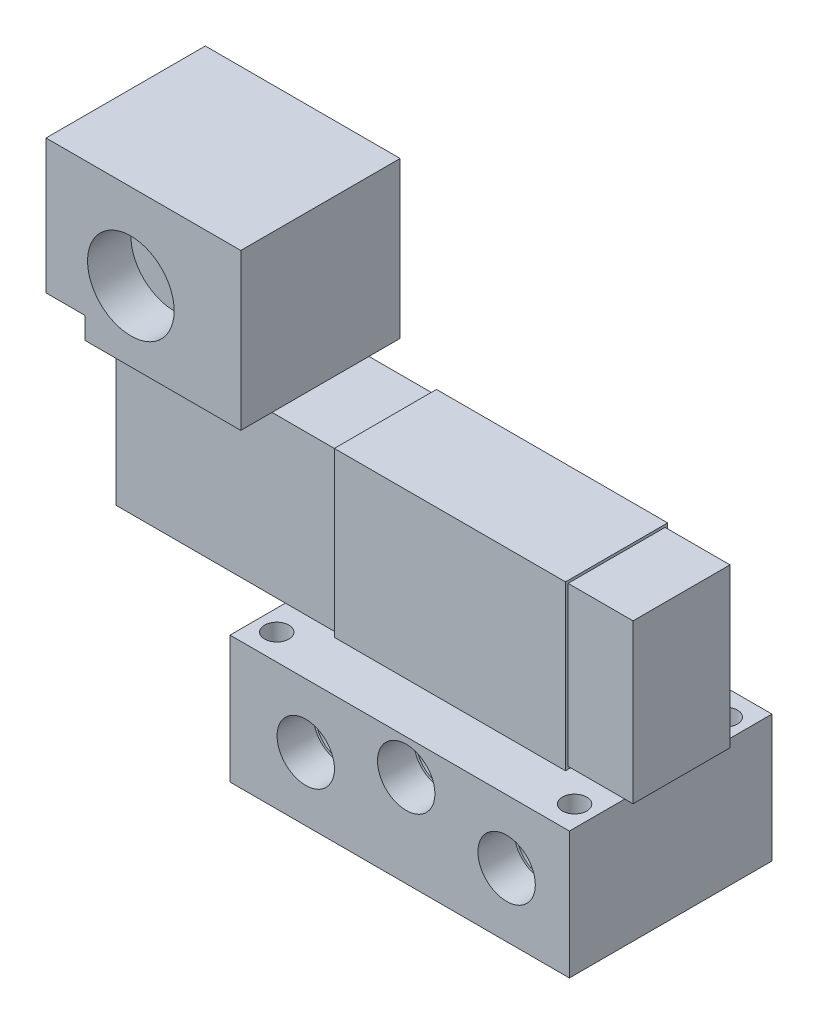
ISO-10303-21;
HEADER;
FILE_DESCRIPTION(('STEP AP214'),'2;1');
FILE_NAME('part.step','',(''),(''),'','','');
FILE_SCHEMA(('AUTOMOTIVE_DESIGN { 1 0 10303 214 1 1 1 1 }'));
ENDSEC;
DATA;
#1=APPLICATION_CONTEXT('core data for automotive mechanical design processes');
#2=APPLICATION_PROTOCOL_DEFINITION('international standard','automotive_design',2000,#1);
#3=PRODUCT_CONTEXT('',#1,'mechanical');
#4=PRODUCT('Part','Part','',(#3));
#5=PRODUCT_RELATED_PRODUCT_CATEGORY('part','',(#4));
#6=PRODUCT_DEFINITION_FORMATION('','',#4);
#7=PRODUCT_DEFINITION_CONTEXT('part definition',#1,'design');
#8=PRODUCT_DEFINITION('design','',#6,#7);
#9=PRODUCT_DEFINITION_SHAPE('','',#8);
#10=(LENGTH_UNIT() NAMED_UNIT(*) SI_UNIT(.MILLI.,.METRE.));
#11=(NAMED_UNIT(*) PLANE_ANGLE_UNIT() SI_UNIT($,.RADIAN.));
#12=(NAMED_UNIT(*) SI_UNIT($,.STERADIAN.) SOLID_ANGLE_UNIT());
#13=UNCERTAINTY_MEASURE_WITH_UNIT(LENGTH_MEASURE(1.E-05),#10,'distance_accuracy_value','');
#14=(GEOMETRIC_REPRESENTATION_CONTEXT(3) GLOBAL_UNCERTAINTY_ASSIGNED_CONTEXT((#13)) GLOBAL_UNIT_ASSIGNED_CONTEXT((#10,
#11,#12)) REPRESENTATION_CONTEXT('',''));
#15=CARTESIAN_POINT('',(0.,0.,0.));
#16=DIRECTION('',(0.,0.,1.));
#17=DIRECTION('',(1.,0.,0.));
#18=AXIS2_PLACEMENT_3D('',#15,#16,#17);
#19=CARTESIAN_POINT('',(83.693,85.344,-14.986));
#20=DIRECTION('',(1.,0.,0.));
#21=DIRECTION('',(0.,0.,-1.));
#22=AXIS2_PLACEMENT_3D('',#19,#20,#21);
#23=PLANE('',#22);
#24=DIRECTION('',(0.,0.,1.));
#25=VECTOR('',#24,1.);
#26=CARTESIAN_POINT('',(83.693,37.338,-14.986));
#27=LINE('',#26,#25);
#28=CARTESIAN_POINT('',(83.693,37.338,-14.986));
#29=VERTEX_POINT('',#28);
#30=CARTESIAN_POINT('',(83.693,37.338,14.986));
#31=VERTEX_POINT('',#30);
#32=EDGE_CURVE('E418',#29,#31,#27,.T.);
#33=ORIENTED_EDGE('',*,*,#32,.F.);
#34=DIRECTION('',(0.,-1.,0.));
#35=VECTOR('',#34,1.);
#36=CARTESIAN_POINT('',(83.693,85.344,-14.986));
#37=LINE('',#36,#35);
#38=CARTESIAN_POINT('',(83.693,85.344,-14.986));
#39=VERTEX_POINT('',#38);
#40=EDGE_CURVE('E428',#39,#29,#37,.T.);
#41=ORIENTED_EDGE('',*,*,#40,.F.);
#42=DIRECTION('',(0.,0.,1.));
#43=VECTOR('',#42,1.);
#44=CARTESIAN_POINT('',(83.693,85.344,-14.986));
#45=LINE('',#44,#43);
#46=CARTESIAN_POINT('',(83.693,85.344,14.986));
#47=VERTEX_POINT('',#46);
#48=EDGE_CURVE('E407',#39,#47,#45,.T.);
#49=ORIENTED_EDGE('',*,*,#48,.T.);
#50=DIRECTION('',(0.,-1.,0.));
#51=VECTOR('',#50,1.);
#52=CARTESIAN_POINT('',(83.693,85.344,14.986));
#53=LINE('',#52,#51);
#54=EDGE_CURVE('E426',#47,#31,#53,.T.);
#55=ORIENTED_EDGE('',*,*,#54,.T.);
#56=EDGE_LOOP('',(#33,#41,#49,#55));
#57=FACE_BOUND('',#56,.T.);
#58=DIRECTION('',(0.,0.,-1.));
#59=VECTOR('',#58,1.);
#60=CARTESIAN_POINT('',(83.693,38.1,14.224));
#61=LINE('',#60,#59);
#62=CARTESIAN_POINT('',(83.693,38.1,14.224));
#63=VERTEX_POINT('',#62);
#64=CARTESIAN_POINT('',(83.693,38.1,-14.224));
#65=VERTEX_POINT('',#64);
#66=EDGE_CURVE('E385',#63,#65,#61,.T.);
#67=ORIENTED_EDGE('',*,*,#66,.F.);
#68=DIRECTION('',(0.,-1.,0.));
#69=VECTOR('',#68,1.);
#70=CARTESIAN_POINT('',(83.693,84.582,14.224));
#71=LINE('',#70,#69);
#72=CARTESIAN_POINT('',(83.693,84.582,14.224));
#73=VERTEX_POINT('',#72);
#74=EDGE_CURVE('E371',#73,#63,#71,.T.);
#75=ORIENTED_EDGE('',*,*,#74,.F.);
#76=DIRECTION('',(0.,0.,1.));
#77=VECTOR('',#76,1.);
#78=CARTESIAN_POINT('',(83.693,84.582,-14.224));
#79=LINE('',#78,#77);
#80=CARTESIAN_POINT('',(83.693,84.582,-14.224));
#81=VERTEX_POINT('',#80);
#82=EDGE_CURVE('E376',#81,#73,#79,.T.);
#83=ORIENTED_EDGE('',*,*,#82,.F.);
#84=DIRECTION('',(0.,1.,0.));
#85=VECTOR('',#84,1.);
#86=CARTESIAN_POINT('',(83.693,38.1,-14.224));
#87=LINE('',#86,#85);
#88=EDGE_CURVE('E387',#65,#81,#87,.T.);
#89=ORIENTED_EDGE('',*,*,#88,.F.);
#90=EDGE_LOOP('',(#67,#75,#83,#89));
#91=FACE_BOUND('',#90,.T.);
#92=ADVANCED_FACE('F34',(#57,#91),#23,.T.);
#93=CARTESIAN_POINT('',(0.,37.338,29.718));
#94=DIRECTION('',(1.,0.,0.));
#95=DIRECTION('',(0.,1.,0.));
#96=AXIS2_PLACEMENT_3D('',#93,#94,#95);
#97=PLANE('',#96);
#98=DIRECTION('',(0.,-1.,0.));
#99=VECTOR('',#98,1.);
#100=CARTESIAN_POINT('',(0.,37.338,-29.718));
#101=LINE('',#100,#99);
#102=CARTESIAN_POINT('',(0.,37.338,-29.718));
#103=VERTEX_POINT('',#102);
#104=CARTESIAN_POINT('',(0.,0.,-29.718));
#105=VERTEX_POINT('',#104);
#106=EDGE_CURVE('E425',#103,#105,#101,.T.);
#107=ORIENTED_EDGE('',*,*,#106,.T.);
#108=DIRECTION('',(0.,0.,-1.));
#109=VECTOR('',#108,1.);
#110=CARTESIAN_POINT('',(0.,0.,29.718));
#111=LINE('',#110,#109);
#112=CARTESIAN_POINT('',(0.,0.,29.718));
#113=VERTEX_POINT('',#112);
#114=EDGE_CURVE('E11',#113,#105,#111,.T.);
#115=ORIENTED_EDGE('',*,*,#114,.F.);
#116=DIRECTION('',(0.,-1.,0.));
#117=VECTOR('',#116,1.);
#118=CARTESIAN_POINT('',(0.,37.338,29.718));
#119=LINE('',#118,#117);
#120=CARTESIAN_POINT('',(0.,37.338,29.718));
#121=VERTEX_POINT('',#120);
#122=EDGE_CURVE('E432',#121,#113,#119,.T.);
#123=ORIENTED_EDGE('',*,*,#122,.F.);
#124=DIRECTION('',(0.,0.,-1.));
#125=VECTOR('',#124,1.);
#126=CARTESIAN_POINT('',(0.,37.338,29.718));
#127=LINE('',#126,#125);
#128=EDGE_CURVE('E443',#121,#103,#127,.T.);
#129=ORIENTED_EDGE('',*,*,#128,.T.);
#130=EDGE_LOOP('',(#107,#115,#123,#129));
#131=FACE_BOUND('',#130,.T.);
#132=ADVANCED_FACE('F36',(#131),#97,.F.);
#133=CARTESIAN_POINT('',(99.568,0.,29.718));
#134=DIRECTION('',(0.,-1.,0.));
#135=DIRECTION('',(1.,0.,0.));
#136=AXIS2_PLACEMENT_3D('',#133,#134,#135);
#137=PLANE('',#136);
#138=CARTESIAN_POINT('',(6.096,0.,-22.098));
#139=DIRECTION('',(0.,1.,0.));
#140=DIRECTION('',(-1.,0.,0.));
#141=AXIS2_PLACEMENT_3D('',#138,#139,#140);
#142=CIRCLE('',#141,3.5687);
#143=CARTESIAN_POINT('',(2.5273,0.,-22.098));
#144=VERTEX_POINT('',#143);
#145=EDGE_CURVE('E743',#144,#144,#142,.T.);
#146=ORIENTED_EDGE('',*,*,#145,.T.);
#147=EDGE_LOOP('',(#146));
#148=FACE_BOUND('',#147,.T.);
#149=CARTESIAN_POINT('',(6.096,0.,22.098));
#150=DIRECTION('',(0.,1.,0.));
#151=DIRECTION('',(-1.,0.,0.));
#152=AXIS2_PLACEMENT_3D('',#149,#150,#151);
#153=CIRCLE('',#152,3.5687);
#154=CARTESIAN_POINT('',(2.5273,0.,22.098));
#155=VERTEX_POINT('',#154);
#156=EDGE_CURVE('E751',#155,#155,#153,.T.);
#157=ORIENTED_EDGE('',*,*,#156,.T.);
#158=EDGE_LOOP('',(#157));
#159=FACE_BOUND('',#158,.T.);
#160=CARTESIAN_POINT('',(93.472,0.,-22.098));
#161=DIRECTION('',(0.,1.,0.));
#162=DIRECTION('',(-1.,0.,0.));
#163=AXIS2_PLACEMENT_3D('',#160,#161,#162);
#164=CIRCLE('',#163,3.5687);
#165=CARTESIAN_POINT('',(89.9033,0.,-22.098));
#166=VERTEX_POINT('',#165);
#167=EDGE_CURVE('E757',#166,#166,#164,.T.);
#168=ORIENTED_EDGE('',*,*,#167,.T.);
#169=EDGE_LOOP('',(#168));
#170=FACE_BOUND('',#169,.T.);
#171=CARTESIAN_POINT('',(93.472,0.,22.098));
#172=DIRECTION('',(0.,1.,0.));
#173=DIRECTION('',(-1.,0.,0.));
#174=AXIS2_PLACEMENT_3D('',#171,#172,#173);
#175=CIRCLE('',#174,3.5687);
#176=CARTESIAN_POINT('',(89.9033,0.,22.098));
#177=VERTEX_POINT('',#176);
#178=EDGE_CURVE('E218',#177,#177,#175,.T.);
#179=ORIENTED_EDGE('',*,*,#178,.T.);
#180=EDGE_LOOP('',(#179));
#181=FACE_BOUND('',#180,.T.);
#182=DIRECTION('',(-1.,0.,0.));
#183=VECTOR('',#182,1.);
#184=CARTESIAN_POINT('',(99.568,0.,-29.718));
#185=LINE('',#184,#183);
#186=CARTESIAN_POINT('',(99.568,0.,-29.718));
#187=VERTEX_POINT('',#186);
#188=EDGE_CURVE('E446',#187,#105,#185,.T.);
#189=ORIENTED_EDGE('',*,*,#188,.F.);
#190=DIRECTION('',(0.,0.,-1.));
#191=VECTOR('',#190,1.);
#192=CARTESIAN_POINT('',(99.568,0.,29.718));
#193=LINE('',#192,#191);
#194=CARTESIAN_POINT('',(99.568,0.,29.718));
#195=VERTEX_POINT('',#194);
#196=EDGE_CURVE('E43',#195,#187,#193,.T.);
#197=ORIENTED_EDGE('',*,*,#196,.F.);
#198=DIRECTION('',(-1.,0.,0.));
#199=VECTOR('',#198,1.);
#200=CARTESIAN_POINT('',(99.568,0.,29.718));
#201=LINE('',#200,#199);
#202=EDGE_CURVE('E434',#195,#113,#201,.T.);
#203=ORIENTED_EDGE('',*,*,#202,.T.);
#204=ORIENTED_EDGE('',*,*,#114,.T.);
#205=EDGE_LOOP('',(#189,#197,#203,#204));
#206=FACE_BOUND('',#205,.T.);
#207=ADVANCED_FACE('F508',(#148,#159,#170,#181,#206),#137,.T.);
#208=CARTESIAN_POINT('',(99.568,0.,29.718));
#209=DIRECTION('',(-1.,0.,0.));
#210=DIRECTION('',(0.,-1.,0.));
#211=AXIS2_PLACEMENT_3D('',#208,#209,#210);
#212=PLANE('',#211);
#213=DIRECTION('',(0.,1.,0.));
#214=VECTOR('',#213,1.);
#215=CARTESIAN_POINT('',(99.568,0.,-29.718));
#216=LINE('',#215,#214);
#217=CARTESIAN_POINT('',(99.568,37.338,-29.718));
#218=VERTEX_POINT('',#217);
#219=EDGE_CURVE('E449',#187,#218,#216,.T.);
#220=ORIENTED_EDGE('',*,*,#219,.T.);
#221=DIRECTION('',(0.,0.,-1.));
#222=VECTOR('',#221,1.);
#223=CARTESIAN_POINT('',(99.568,37.338,29.718));
#224=LINE('',#223,#222);
#225=CARTESIAN_POINT('',(99.568,37.338,29.718));
#226=VERTEX_POINT('',#225);
#227=EDGE_CURVE('E455',#226,#218,#224,.T.);
#228=ORIENTED_EDGE('',*,*,#227,.F.);
#229=DIRECTION('',(0.,1.,0.));
#230=VECTOR('',#229,1.);
#231=CARTESIAN_POINT('',(99.568,0.,29.718));
#232=LINE('',#231,#230);
#233=EDGE_CURVE('E438',#195,#226,#232,.T.);
#234=ORIENTED_EDGE('',*,*,#233,.F.);
#235=ORIENTED_EDGE('',*,*,#196,.T.);
#236=EDGE_LOOP('',(#220,#228,#234,#235));
#237=FACE_BOUND('',#236,.T.);
#238=ADVANCED_FACE('F506',(#237),#212,.F.);
#239=CARTESIAN_POINT('',(0.,37.338,29.718));
#240=DIRECTION('',(0.,1.,0.));
#241=DIRECTION('',(-1.,0.,0.));
#242=AXIS2_PLACEMENT_3D('',#239,#240,#241);
#243=PLANE('',#242);
#244=CARTESIAN_POINT('',(6.09599999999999,37.338,-22.098));
#245=DIRECTION('',(0.,1.,0.));
#246=DIRECTION('',(-1.,0.,0.));
#247=AXIS2_PLACEMENT_3D('',#244,#245,#246);
#248=CIRCLE('',#247,3.5687);
#249=CARTESIAN_POINT('',(2.52729999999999,37.338,-22.098));
#250=VERTEX_POINT('',#249);
#251=EDGE_CURVE('E746',#250,#250,#248,.T.);
#252=ORIENTED_EDGE('',*,*,#251,.F.);
#253=EDGE_LOOP('',(#252));
#254=FACE_BOUND('',#253,.T.);
#255=CARTESIAN_POINT('',(6.09599999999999,37.338,22.098));
#256=DIRECTION('',(0.,1.,0.));
#257=DIRECTION('',(-1.,0.,0.));
#258=AXIS2_PLACEMENT_3D('',#255,#256,#257);
#259=CIRCLE('',#258,3.5687);
#260=CARTESIAN_POINT('',(2.52729999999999,37.338,22.098));
#261=VERTEX_POINT('',#260);
#262=EDGE_CURVE('E748',#261,#261,#259,.T.);
#263=ORIENTED_EDGE('',*,*,#262,.F.);
#264=EDGE_LOOP('',(#263));
#265=FACE_BOUND('',#264,.T.);
#266=CARTESIAN_POINT('',(93.472,37.338,-22.098));
#267=DIRECTION('',(0.,1.,0.));
#268=DIRECTION('',(-1.,0.,0.));
#269=AXIS2_PLACEMENT_3D('',#266,#267,#268);
#270=CIRCLE('',#269,3.5687);
#271=CARTESIAN_POINT('',(89.9033,37.338,-22.098));
#272=VERTEX_POINT('',#271);
#273=EDGE_CURVE('E754',#272,#272,#270,.T.);
#274=ORIENTED_EDGE('',*,*,#273,.F.);
#275=EDGE_LOOP('',(#274));
#276=FACE_BOUND('',#275,.T.);
#277=CARTESIAN_POINT('',(93.472,37.338,22.098));
#278=DIRECTION('',(0.,1.,0.));
#279=DIRECTION('',(-1.,0.,0.));
#280=AXIS2_PLACEMENT_3D('',#277,#278,#279);
#281=CIRCLE('',#280,3.5687);
#282=CARTESIAN_POINT('',(89.9033,37.338,22.098));
#283=VERTEX_POINT('',#282);
#284=EDGE_CURVE('E223',#283,#283,#281,.T.);
#285=ORIENTED_EDGE('',*,*,#284,.F.);
#286=EDGE_LOOP('',(#285));
#287=FACE_BOUND('',#286,.T.);
#288=DIRECTION('',(0.,0.,-1.));
#289=VECTOR('',#288,1.);
#290=CARTESIAN_POINT('',(15.875,37.338,14.986));
#291=LINE('',#290,#289);
#292=CARTESIAN_POINT('',(15.875,37.338,14.986));
#293=VERTEX_POINT('',#292);
#294=CARTESIAN_POINT('',(15.875,37.338,-14.986));
#295=VERTEX_POINT('',#294);
#296=EDGE_CURVE('E400',#293,#295,#291,.T.);
#297=ORIENTED_EDGE('',*,*,#296,.T.);
#298=DIRECTION('',(-1.,0.,0.));
#299=VECTOR('',#298,1.);
#300=CARTESIAN_POINT('',(83.693,37.338,-14.986));
#301=LINE('',#300,#299);
#302=EDGE_CURVE('E415',#29,#295,#301,.T.);
#303=ORIENTED_EDGE('',*,*,#302,.F.);
#304=ORIENTED_EDGE('',*,*,#32,.T.);
#305=DIRECTION('',(1.,0.,0.));
#306=VECTOR('',#305,1.);
#307=CARTESIAN_POINT('',(15.875,37.338,14.986));
#308=LINE('',#307,#306);
#309=EDGE_CURVE('E405',#293,#31,#308,.T.);
#310=ORIENTED_EDGE('',*,*,#309,.F.);
#311=EDGE_LOOP('',(#297,#303,#304,#310));
#312=FACE_BOUND('',#311,.T.);
#313=DIRECTION('',(1.,0.,0.));
#314=VECTOR('',#313,1.);
#315=CARTESIAN_POINT('',(0.,37.338,-29.718));
#316=LINE('',#315,#314);
#317=EDGE_CURVE('E435',#103,#218,#316,.T.);
#318=ORIENTED_EDGE('',*,*,#317,.F.);
#319=ORIENTED_EDGE('',*,*,#128,.F.);
#320=DIRECTION('',(1.,0.,0.));
#321=VECTOR('',#320,1.);
#322=CARTESIAN_POINT('',(0.,37.338,29.718));
#323=LINE('',#322,#321);
#324=EDGE_CURVE('E440',#121,#226,#323,.T.);
#325=ORIENTED_EDGE('',*,*,#324,.T.);
#326=ORIENTED_EDGE('',*,*,#227,.T.);
#327=EDGE_LOOP('',(#318,#319,#325,#326));
#328=FACE_BOUND('',#327,.T.);
#329=ADVANCED_FACE('F500',(#254,#265,#276,#287,#312,#328),#243,.T.);
#330=CARTESIAN_POINT('',(0.,0.,29.718));
#331=DIRECTION('',(0.,0.,-1.));
#332=DIRECTION('',(-1.,0.,0.));
#333=AXIS2_PLACEMENT_3D('',#330,#331,#332);
#334=PLANE('',#333);
#335=CARTESIAN_POINT('',(22.225,18.669,29.7180000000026));
#336=DIRECTION('',(0.,0.,1.));
#337=DIRECTION('',(1.,0.,0.));
#338=AXIS2_PLACEMENT_3D('',#335,#336,#337);
#339=CIRCLE('',#338,8.4201);
#340=CARTESIAN_POINT('',(30.6451,18.669,29.7180000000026));
#341=VERTEX_POINT('',#340);
#342=EDGE_CURVE('E256',#341,#341,#339,.T.);
#343=ORIENTED_EDGE('',*,*,#342,.F.);
#344=EDGE_LOOP('',(#343));
#345=FACE_BOUND('',#344,.T.);
#346=CARTESIAN_POINT('',(81.153,18.669,29.7180000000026));
#347=DIRECTION('',(0.,0.,1.));
#348=DIRECTION('',(1.,0.,0.));
#349=AXIS2_PLACEMENT_3D('',#346,#347,#348);
#350=CIRCLE('',#349,8.42009999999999);
#351=CARTESIAN_POINT('',(89.5731,18.669,29.7180000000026));
#352=VERTEX_POINT('',#351);
#353=EDGE_CURVE('E266',#352,#352,#350,.T.);
#354=ORIENTED_EDGE('',*,*,#353,.F.);
#355=EDGE_LOOP('',(#354));
#356=FACE_BOUND('',#355,.T.);
#357=CARTESIAN_POINT('',(51.689,27.051,29.7180000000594));
#358=DIRECTION('',(0.,0.,1.));
#359=DIRECTION('',(1.,0.,0.));
#360=AXIS2_PLACEMENT_3D('',#357,#358,#359);
#361=CIRCLE('',#360,8.4201);
#362=CARTESIAN_POINT('',(60.1091,27.051,29.7180000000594));
#363=VERTEX_POINT('',#362);
#364=EDGE_CURVE('E276',#363,#363,#361,.T.);
#365=ORIENTED_EDGE('',*,*,#364,.F.);
#366=EDGE_LOOP('',(#365));
#367=FACE_BOUND('',#366,.T.);
#368=ORIENTED_EDGE('',*,*,#122,.T.);
#369=ORIENTED_EDGE('',*,*,#202,.F.);
#370=ORIENTED_EDGE('',*,*,#233,.T.);
#371=ORIENTED_EDGE('',*,*,#324,.F.);
#372=EDGE_LOOP('',(#368,#369,#370,#371));
#373=FACE_BOUND('',#372,.T.);
#374=ADVANCED_FACE('F488',(#345,#356,#367,#373),#334,.F.);
#375=CARTESIAN_POINT('',(0.,0.,-29.718));
#376=DIRECTION('',(0.,0.,-1.));
#377=DIRECTION('',(-1.,0.,0.));
#378=AXIS2_PLACEMENT_3D('',#375,#376,#377);
#379=PLANE('',#378);
#380=CARTESIAN_POINT('',(22.225,18.669,-29.7179999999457));
#381=DIRECTION('',(0.,0.,-1.));
#382=DIRECTION('',(-1.,0.,0.));
#383=AXIS2_PLACEMENT_3D('',#380,#381,#382);
#384=CIRCLE('',#383,8.4201);
#385=CARTESIAN_POINT('',(13.8049,18.669,-29.7179999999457));
#386=VERTEX_POINT('',#385);
#387=EDGE_CURVE('E221',#386,#386,#384,.T.);
#388=ORIENTED_EDGE('',*,*,#387,.F.);
#389=EDGE_LOOP('',(#388));
#390=FACE_BOUND('',#389,.T.);
#391=CARTESIAN_POINT('',(51.689,27.051,-29.7180000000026));
#392=DIRECTION('',(0.,0.,-1.));
#393=DIRECTION('',(-1.,0.,0.));
#394=AXIS2_PLACEMENT_3D('',#391,#392,#393);
#395=CIRCLE('',#394,8.4201);
#396=CARTESIAN_POINT('',(43.2689,27.051,-29.7180000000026));
#397=VERTEX_POINT('',#396);
#398=EDGE_CURVE('E236',#397,#397,#395,.T.);
#399=ORIENTED_EDGE('',*,*,#398,.F.);
#400=EDGE_LOOP('',(#399));
#401=FACE_BOUND('',#400,.T.);
#402=CARTESIAN_POINT('',(81.153,18.669,-29.7180000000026));
#403=DIRECTION('',(0.,0.,-1.));
#404=DIRECTION('',(-1.,0.,0.));
#405=AXIS2_PLACEMENT_3D('',#402,#403,#404);
#406=CIRCLE('',#405,8.42009999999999);
#407=CARTESIAN_POINT('',(72.7329,18.669,-29.7180000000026));
#408=VERTEX_POINT('',#407);
#409=EDGE_CURVE('E246',#408,#408,#406,.T.);
#410=ORIENTED_EDGE('',*,*,#409,.F.);
#411=EDGE_LOOP('',(#410));
#412=FACE_BOUND('',#411,.T.);
#413=ORIENTED_EDGE('',*,*,#106,.F.);
#414=ORIENTED_EDGE('',*,*,#317,.T.);
#415=ORIENTED_EDGE('',*,*,#219,.F.);
#416=ORIENTED_EDGE('',*,*,#188,.T.);
#417=EDGE_LOOP('',(#413,#414,#415,#416));
#418=FACE_BOUND('',#417,.T.);
#419=ADVANCED_FACE('F484',(#390,#401,#412,#418),#379,.T.);
#420=CARTESIAN_POINT('',(15.875,85.344,14.986));
#421=DIRECTION('',(-1.,0.,0.));
#422=DIRECTION('',(0.,0.,1.));
#423=AXIS2_PLACEMENT_3D('',#420,#421,#422);
#424=PLANE('',#423);
#425=DIRECTION('',(0.,0.,1.));
#426=VECTOR('',#425,1.);
#427=CARTESIAN_POINT('',(15.875,84.582,-14.224));
#428=LINE('',#427,#426);
#429=CARTESIAN_POINT('',(15.875,84.582,-14.224));
#430=VERTEX_POINT('',#429);
#431=CARTESIAN_POINT('',(15.875,84.582,14.224));
#432=VERTEX_POINT('',#431);
#433=EDGE_CURVE('E333',#430,#432,#428,.T.);
#434=ORIENTED_EDGE('',*,*,#433,.T.);
#435=DIRECTION('',(0.,-1.,0.));
#436=VECTOR('',#435,1.);
#437=CARTESIAN_POINT('',(15.875,84.582,14.224));
#438=LINE('',#437,#436);
#439=CARTESIAN_POINT('',(15.875,38.1,14.224));
#440=VERTEX_POINT('',#439);
#441=EDGE_CURVE('E355',#432,#440,#438,.T.);
#442=ORIENTED_EDGE('',*,*,#441,.T.);
#443=DIRECTION('',(0.,0.,-1.));
#444=VECTOR('',#443,1.);
#445=CARTESIAN_POINT('',(15.875,38.1,14.224));
#446=LINE('',#445,#444);
#447=CARTESIAN_POINT('',(15.875,38.1,-14.224));
#448=VERTEX_POINT('',#447);
#449=EDGE_CURVE('E58',#440,#448,#446,.T.);
#450=ORIENTED_EDGE('',*,*,#449,.T.);
#451=DIRECTION('',(0.,1.,0.));
#452=VECTOR('',#451,1.);
#453=CARTESIAN_POINT('',(15.875,38.1,-14.224));
#454=LINE('',#453,#452);
#455=EDGE_CURVE('E358',#448,#430,#454,.T.);
#456=ORIENTED_EDGE('',*,*,#455,.T.);
#457=EDGE_LOOP('',(#434,#442,#450,#456));
#458=FACE_BOUND('',#457,.T.);
#459=ORIENTED_EDGE('',*,*,#296,.F.);
#460=DIRECTION('',(0.,-1.,0.));
#461=VECTOR('',#460,1.);
#462=CARTESIAN_POINT('',(15.875,85.344,14.986));
#463=LINE('',#462,#461);
#464=CARTESIAN_POINT('',(15.875,85.344,14.986));
#465=VERTEX_POINT('',#464);
#466=EDGE_CURVE('E423',#465,#293,#463,.T.);
#467=ORIENTED_EDGE('',*,*,#466,.F.);
#468=DIRECTION('',(0.,0.,-1.));
#469=VECTOR('',#468,1.);
#470=CARTESIAN_POINT('',(15.875,85.344,14.986));
#471=LINE('',#470,#469);
#472=CARTESIAN_POINT('',(15.875,85.344,-14.986));
#473=VERTEX_POINT('',#472);
#474=EDGE_CURVE('E401',#465,#473,#471,.T.);
#475=ORIENTED_EDGE('',*,*,#474,.T.);
#476=DIRECTION('',(0.,-1.,0.));
#477=VECTOR('',#476,1.);
#478=CARTESIAN_POINT('',(15.875,85.344,-14.986));
#479=LINE('',#478,#477);
#480=EDGE_CURVE('E412',#473,#295,#479,.T.);
#481=ORIENTED_EDGE('',*,*,#480,.T.);
#482=EDGE_LOOP('',(#459,#467,#475,#481));
#483=FACE_BOUND('',#482,.T.);
#484=ADVANCED_FACE('F487',(#458,#483),#424,.T.);
#485=CARTESIAN_POINT('',(15.875,85.344,14.986));
#486=DIRECTION('',(0.,0.,-1.));
#487=DIRECTION('',(-1.,0.,0.));
#488=AXIS2_PLACEMENT_3D('',#485,#486,#487);
#489=PLANE('',#488);
#490=ORIENTED_EDGE('',*,*,#309,.T.);
#491=ORIENTED_EDGE('',*,*,#54,.F.);
#492=DIRECTION('',(1.,0.,0.));
#493=VECTOR('',#492,1.);
#494=CARTESIAN_POINT('',(15.875,85.344,14.986));
#495=LINE('',#494,#493);
#496=EDGE_CURVE('E410',#465,#47,#495,.T.);
#497=ORIENTED_EDGE('',*,*,#496,.F.);
#498=ORIENTED_EDGE('',*,*,#466,.T.);
#499=EDGE_LOOP('',(#490,#491,#497,#498));
#500=FACE_BOUND('',#499,.T.);
#501=ADVANCED_FACE('F531',(#500),#489,.F.);
#502=CARTESIAN_POINT('',(83.693,85.344,-14.986));
#503=DIRECTION('',(0.,0.,1.));
#504=DIRECTION('',(1.,0.,0.));
#505=AXIS2_PLACEMENT_3D('',#502,#503,#504);
#506=PLANE('',#505);
#507=ORIENTED_EDGE('',*,*,#302,.T.);
#508=ORIENTED_EDGE('',*,*,#480,.F.);
#509=DIRECTION('',(-1.,0.,0.));
#510=VECTOR('',#509,1.);
#511=CARTESIAN_POINT('',(83.693,85.344,-14.986));
#512=LINE('',#511,#510);
#513=EDGE_CURVE('E404',#39,#473,#512,.T.);
#514=ORIENTED_EDGE('',*,*,#513,.F.);
#515=ORIENTED_EDGE('',*,*,#40,.T.);
#516=EDGE_LOOP('',(#507,#508,#514,#515));
#517=FACE_BOUND('',#516,.T.);
#518=ADVANCED_FACE('F533',(#517),#506,.F.);
#519=CARTESIAN_POINT('',(15.875,85.344,14.986));
#520=DIRECTION('',(0.,-1.,0.));
#521=DIRECTION('',(1.,0.,0.));
#522=AXIS2_PLACEMENT_3D('',#519,#520,#521);
#523=PLANE('',#522);
#524=ORIENTED_EDGE('',*,*,#474,.F.);
#525=ORIENTED_EDGE('',*,*,#496,.T.);
#526=ORIENTED_EDGE('',*,*,#48,.F.);
#527=ORIENTED_EDGE('',*,*,#513,.T.);
#528=EDGE_LOOP('',(#524,#525,#526,#527));
#529=FACE_BOUND('',#528,.T.);
#530=ADVANCED_FACE('F535',(#529),#523,.F.);
#531=CARTESIAN_POINT('',(102.743,84.582,14.224));
#532=DIRECTION('',(0.,0.,-1.));
#533=DIRECTION('',(-1.,0.,0.));
#534=AXIS2_PLACEMENT_3D('',#531,#532,#533);
#535=PLANE('',#534);
#536=ORIENTED_EDGE('',*,*,#74,.T.);
#537=DIRECTION('',(-1.,0.,0.));
#538=VECTOR('',#537,1.);
#539=CARTESIAN_POINT('',(102.743,38.1,14.224));
#540=LINE('',#539,#538);
#541=CARTESIAN_POINT('',(102.743,38.1,14.224));
#542=VERTEX_POINT('',#541);
#543=EDGE_CURVE('E398',#542,#63,#540,.T.);
#544=ORIENTED_EDGE('',*,*,#543,.F.);
#545=DIRECTION('',(0.,-1.,0.));
#546=VECTOR('',#545,1.);
#547=CARTESIAN_POINT('',(102.743,84.582,14.224));
#548=LINE('',#547,#546);
#549=CARTESIAN_POINT('',(102.743,84.582,14.224));
#550=VERTEX_POINT('',#549);
#551=EDGE_CURVE('E372',#550,#542,#548,.T.);
#552=ORIENTED_EDGE('',*,*,#551,.F.);
#553=DIRECTION('',(-1.,0.,0.));
#554=VECTOR('',#553,1.);
#555=CARTESIAN_POINT('',(102.743,84.582,14.224));
#556=LINE('',#555,#554);
#557=EDGE_CURVE('E382',#550,#73,#556,.T.);
#558=ORIENTED_EDGE('',*,*,#557,.T.);
#559=EDGE_LOOP('',(#536,#544,#552,#558));
#560=FACE_BOUND('',#559,.T.);
#561=ADVANCED_FACE('F557',(#560),#535,.F.);
#562=CARTESIAN_POINT('',(102.743,38.1,14.224));
#563=DIRECTION('',(0.,1.,0.));
#564=DIRECTION('',(-1.,0.,0.));
#565=AXIS2_PLACEMENT_3D('',#562,#563,#564);
#566=PLANE('',#565);
#567=ORIENTED_EDGE('',*,*,#66,.T.);
#568=DIRECTION('',(-1.,0.,0.));
#569=VECTOR('',#568,1.);
#570=CARTESIAN_POINT('',(102.743,38.1,-14.224));
#571=LINE('',#570,#569);
#572=CARTESIAN_POINT('',(102.743,38.1,-14.224));
#573=VERTEX_POINT('',#572);
#574=EDGE_CURVE('E395',#573,#65,#571,.T.);
#575=ORIENTED_EDGE('',*,*,#574,.F.);
#576=DIRECTION('',(0.,0.,-1.));
#577=VECTOR('',#576,1.);
#578=CARTESIAN_POINT('',(102.743,38.1,14.224));
#579=LINE('',#578,#577);
#580=EDGE_CURVE('E375',#542,#573,#579,.T.);
#581=ORIENTED_EDGE('',*,*,#580,.F.);
#582=ORIENTED_EDGE('',*,*,#543,.T.);
#583=EDGE_LOOP('',(#567,#575,#581,#582));
#584=FACE_BOUND('',#583,.T.);
#585=ADVANCED_FACE('F561',(#584),#566,.F.);
#586=CARTESIAN_POINT('',(102.743,38.1,-14.224));
#587=DIRECTION('',(0.,0.,1.));
#588=DIRECTION('',(1.,0.,0.));
#589=AXIS2_PLACEMENT_3D('',#586,#587,#588);
#590=PLANE('',#589);
#591=ORIENTED_EDGE('',*,*,#88,.T.);
#592=DIRECTION('',(-1.,0.,0.));
#593=VECTOR('',#592,1.);
#594=CARTESIAN_POINT('',(102.743,84.582,-14.224));
#595=LINE('',#594,#593);
#596=CARTESIAN_POINT('',(102.743,84.582,-14.224));
#597=VERTEX_POINT('',#596);
#598=EDGE_CURVE('E393',#597,#81,#595,.T.);
#599=ORIENTED_EDGE('',*,*,#598,.F.);
#600=DIRECTION('',(0.,1.,0.));
#601=VECTOR('',#600,1.);
#602=CARTESIAN_POINT('',(102.743,38.1,-14.224));
#603=LINE('',#602,#601);
#604=EDGE_CURVE('E378',#573,#597,#603,.T.);
#605=ORIENTED_EDGE('',*,*,#604,.F.);
#606=ORIENTED_EDGE('',*,*,#574,.T.);
#607=EDGE_LOOP('',(#591,#599,#605,#606));
#608=FACE_BOUND('',#607,.T.);
#609=ADVANCED_FACE('F567',(#608),#590,.F.);
#610=CARTESIAN_POINT('',(102.743,84.582,-14.224));
#611=DIRECTION('',(0.,-1.,0.));
#612=DIRECTION('',(1.,0.,0.));
#613=AXIS2_PLACEMENT_3D('',#610,#611,#612);
#614=PLANE('',#613);
#615=ORIENTED_EDGE('',*,*,#82,.T.);
#616=ORIENTED_EDGE('',*,*,#557,.F.);
#617=DIRECTION('',(0.,0.,1.));
#618=VECTOR('',#617,1.);
#619=CARTESIAN_POINT('',(102.743,84.582,-14.224));
#620=LINE('',#619,#618);
#621=EDGE_CURVE('E380',#597,#550,#620,.T.);
#622=ORIENTED_EDGE('',*,*,#621,.F.);
#623=ORIENTED_EDGE('',*,*,#598,.T.);
#624=EDGE_LOOP('',(#615,#616,#622,#623));
#625=FACE_BOUND('',#624,.T.);
#626=ADVANCED_FACE('F571',(#625),#614,.F.);
#627=CARTESIAN_POINT('',(102.743,38.1,14.224));
#628=DIRECTION('',(1.,0.,0.));
#629=DIRECTION('',(0.,0.,-1.));
#630=AXIS2_PLACEMENT_3D('',#627,#628,#629);
#631=PLANE('',#630);
#632=ORIENTED_EDGE('',*,*,#551,.T.);
#633=ORIENTED_EDGE('',*,*,#580,.T.);
#634=ORIENTED_EDGE('',*,*,#604,.T.);
#635=ORIENTED_EDGE('',*,*,#621,.T.);
#636=EDGE_LOOP('',(#632,#633,#634,#635));
#637=FACE_BOUND('',#636,.T.);
#638=ADVANCED_FACE('F575',(#637),#631,.T.);
#639=CARTESIAN_POINT('',(-103.391468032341,84.582,-14.224));
#640=DIRECTION('',(0.,1.,0.));
#641=DIRECTION('',(-1.,0.,0.));
#642=AXIS2_PLACEMENT_3D('',#639,#640,#641);
#643=PLANE('',#642);
#644=DIRECTION('',(0.,0.,-1.));
#645=VECTOR('',#644,1.);
#646=CARTESIAN_POINT('',(-3.17499999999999,84.582,23.368));
#647=LINE('',#646,#645);
#648=CARTESIAN_POINT('',(-3.17499999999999,84.582,14.224));
#649=VERTEX_POINT('',#648);
#650=CARTESIAN_POINT('',(-3.17499999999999,84.582,-14.224));
#651=VERTEX_POINT('',#650);
#652=EDGE_CURVE('E342',#649,#651,#647,.T.);
#653=ORIENTED_EDGE('',*,*,#652,.F.);
#654=DIRECTION('',(1.,0.,0.));
#655=VECTOR('',#654,1.);
#656=CARTESIAN_POINT('',(-103.391468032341,84.582,14.224));
#657=LINE('',#656,#655);
#658=EDGE_CURVE('E360',#649,#432,#657,.T.);
#659=ORIENTED_EDGE('',*,*,#658,.T.);
#660=ORIENTED_EDGE('',*,*,#433,.F.);
#661=DIRECTION('',(1.,0.,0.));
#662=VECTOR('',#661,1.);
#663=CARTESIAN_POINT('',(-103.391468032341,84.582,-14.224));
#664=LINE('',#663,#662);
#665=EDGE_CURVE('E51',#651,#430,#664,.T.);
#666=ORIENTED_EDGE('',*,*,#665,.F.);
#667=EDGE_LOOP('',(#653,#659,#660,#666));
#668=FACE_BOUND('',#667,.T.);
#669=ADVANCED_FACE('F579',(#668),#643,.T.);
#670=CARTESIAN_POINT('',(-103.391468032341,38.1,-14.224));
#671=DIRECTION('',(0.,0.,-1.));
#672=DIRECTION('',(-1.,0.,0.));
#673=AXIS2_PLACEMENT_3D('',#670,#671,#672);
#674=PLANE('',#673);
#675=DIRECTION('',(0.,-1.,0.));
#676=VECTOR('',#675,1.);
#677=CARTESIAN_POINT('',(-48.895,38.1,-14.224));
#678=LINE('',#677,#676);
#679=CARTESIAN_POINT('',(-48.895,84.582,-14.224));
#680=VERTEX_POINT('',#679);
#681=CARTESIAN_POINT('',(-48.895,38.1,-14.224));
#682=VERTEX_POINT('',#681);
#683=EDGE_CURVE('E349',#680,#682,#678,.T.);
#684=ORIENTED_EDGE('',*,*,#683,.F.);
#685=EDGE_CURVE('E350',#680,#651,#664,.T.);
#686=ORIENTED_EDGE('',*,*,#685,.T.);
#687=ORIENTED_EDGE('',*,*,#665,.T.);
#688=ORIENTED_EDGE('',*,*,#455,.F.);
#689=DIRECTION('',(1.,0.,0.));
#690=VECTOR('',#689,1.);
#691=CARTESIAN_POINT('',(-103.391468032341,38.1,-14.224));
#692=LINE('',#691,#690);
#693=EDGE_CURVE('E362',#682,#448,#692,.T.);
#694=ORIENTED_EDGE('',*,*,#693,.F.);
#695=EDGE_LOOP('',(#684,#686,#687,#688,#694));
#696=FACE_BOUND('',#695,.T.);
#697=ADVANCED_FACE('F583',(#696),#674,.T.);
#698=CARTESIAN_POINT('',(-103.391468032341,38.1,14.224));
#699=DIRECTION('',(0.,-1.,0.));
#700=DIRECTION('',(1.,0.,0.));
#701=AXIS2_PLACEMENT_3D('',#698,#699,#700);
#702=PLANE('',#701);
#703=DIRECTION('',(0.,0.,1.));
#704=VECTOR('',#703,1.);
#705=CARTESIAN_POINT('',(-48.895,38.1,14.224));
#706=LINE('',#705,#704);
#707=CARTESIAN_POINT('',(-48.895,38.1,14.224));
#708=VERTEX_POINT('',#707);
#709=EDGE_CURVE('E347',#682,#708,#706,.T.);
#710=ORIENTED_EDGE('',*,*,#709,.F.);
#711=ORIENTED_EDGE('',*,*,#693,.T.);
#712=ORIENTED_EDGE('',*,*,#449,.F.);
#713=DIRECTION('',(1.,0.,0.));
#714=VECTOR('',#713,1.);
#715=CARTESIAN_POINT('',(-103.391468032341,38.1,14.224));
#716=LINE('',#715,#714);
#717=EDGE_CURVE('E364',#708,#440,#716,.T.);
#718=ORIENTED_EDGE('',*,*,#717,.F.);
#719=EDGE_LOOP('',(#710,#711,#712,#718));
#720=FACE_BOUND('',#719,.T.);
#721=ADVANCED_FACE('F589',(#720),#702,.T.);
#722=CARTESIAN_POINT('',(-103.391468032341,84.582,14.224));
#723=DIRECTION('',(0.,0.,1.));
#724=DIRECTION('',(1.,0.,0.));
#725=AXIS2_PLACEMENT_3D('',#722,#723,#724);
#726=PLANE('',#725);
#727=DIRECTION('',(0.,1.,0.));
#728=VECTOR('',#727,1.);
#729=CARTESIAN_POINT('',(-48.895,84.582,14.224));
#730=LINE('',#729,#728);
#731=CARTESIAN_POINT('',(-48.895,84.582,14.224));
#732=VERTEX_POINT('',#731);
#733=EDGE_CURVE('E352',#708,#732,#730,.T.);
#734=ORIENTED_EDGE('',*,*,#733,.F.);
#735=ORIENTED_EDGE('',*,*,#717,.T.);
#736=ORIENTED_EDGE('',*,*,#441,.F.);
#737=ORIENTED_EDGE('',*,*,#658,.F.);
#738=EDGE_CURVE('E367',#732,#649,#657,.T.);
#739=ORIENTED_EDGE('',*,*,#738,.F.);
#740=EDGE_LOOP('',(#734,#735,#736,#737,#739));
#741=FACE_BOUND('',#740,.T.);
#742=ADVANCED_FACE('F585',(#741),#726,.T.);
#743=CARTESIAN_POINT('',(-48.895,0.,0.));
#744=DIRECTION('',(1.,0.,0.));
#745=DIRECTION('',(0.,0.,-1.));
#746=AXIS2_PLACEMENT_3D('',#743,#744,#745);
#747=PLANE('',#746);
#748=ORIENTED_EDGE('',*,*,#733,.T.);
#749=DIRECTION('',(0.,0.,-1.));
#750=VECTOR('',#749,1.);
#751=CARTESIAN_POINT('',(-48.895,84.582,23.368));
#752=LINE('',#751,#750);
#753=CARTESIAN_POINT('',(-48.895,84.582,23.368));
#754=VERTEX_POINT('',#753);
#755=EDGE_CURVE('E336',#754,#732,#752,.T.);
#756=ORIENTED_EDGE('',*,*,#755,.F.);
#757=DIRECTION('',(0.,1.,0.));
#758=VECTOR('',#757,1.);
#759=CARTESIAN_POINT('',(-48.895,84.582,23.368));
#760=LINE('',#759,#758);
#761=CARTESIAN_POINT('',(-48.895,90.932,23.368));
#762=VERTEX_POINT('',#761);
#763=EDGE_CURVE('E308',#754,#762,#760,.T.);
#764=ORIENTED_EDGE('',*,*,#763,.T.);
#765=DIRECTION('',(0.,0.,-1.));
#766=VECTOR('',#765,1.);
#767=CARTESIAN_POINT('',(-48.895,90.932,23.368));
#768=LINE('',#767,#766);
#769=CARTESIAN_POINT('',(-48.895,90.932,-23.368));
#770=VERTEX_POINT('',#769);
#771=EDGE_CURVE('E334',#762,#770,#768,.T.);
#772=ORIENTED_EDGE('',*,*,#771,.T.);
#773=DIRECTION('',(0.,1.,0.));
#774=VECTOR('',#773,1.);
#775=CARTESIAN_POINT('',(-48.895,84.582,-23.368));
#776=LINE('',#775,#774);
#777=CARTESIAN_POINT('',(-48.895,84.582,-23.368));
#778=VERTEX_POINT('',#777);
#779=EDGE_CURVE('E326',#778,#770,#776,.T.);
#780=ORIENTED_EDGE('',*,*,#779,.F.);
#781=EDGE_CURVE('E338',#680,#778,#752,.T.);
#782=ORIENTED_EDGE('',*,*,#781,.F.);
#783=ORIENTED_EDGE('',*,*,#683,.T.);
#784=ORIENTED_EDGE('',*,*,#709,.T.);
#785=EDGE_LOOP('',(#748,#756,#764,#772,#780,#782,#783,#784));
#786=FACE_BOUND('',#785,.T.);
#787=ADVANCED_FACE('F588',(#786),#747,.F.);
#788=CARTESIAN_POINT('',(-3.17499999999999,84.582,23.368));
#789=DIRECTION('',(0.,-1.,0.));
#790=DIRECTION('',(1.,0.,0.));
#791=AXIS2_PLACEMENT_3D('',#788,#789,#790);
#792=PLANE('',#791);
#793=CARTESIAN_POINT('',(-3.17499999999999,84.582,-23.368));
#794=VERTEX_POINT('',#793);
#795=EDGE_CURVE('E343',#651,#794,#647,.T.);
#796=ORIENTED_EDGE('',*,*,#795,.F.);
#797=ORIENTED_EDGE('',*,*,#685,.F.);
#798=ORIENTED_EDGE('',*,*,#781,.T.);
#799=DIRECTION('',(-1.,0.,0.));
#800=VECTOR('',#799,1.);
#801=CARTESIAN_POINT('',(-3.17499999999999,84.582,-23.368));
#802=LINE('',#801,#800);
#803=EDGE_CURVE('E323',#794,#778,#802,.T.);
#804=ORIENTED_EDGE('',*,*,#803,.F.);
#805=EDGE_LOOP('',(#796,#797,#798,#804));
#806=FACE_BOUND('',#805,.T.);
#807=ADVANCED_FACE('F598',(#806),#792,.T.);
#808=CARTESIAN_POINT('',(-60.325,90.932,23.368));
#809=DIRECTION('',(-1.,0.,0.));
#810=DIRECTION('',(0.,0.,1.));
#811=AXIS2_PLACEMENT_3D('',#808,#809,#810);
#812=PLANE('',#811);
#813=DIRECTION('',(0.,1.,0.));
#814=VECTOR('',#813,1.);
#815=CARTESIAN_POINT('',(-60.325,90.932,-23.368));
#816=LINE('',#815,#814);
#817=CARTESIAN_POINT('',(-60.325,90.932,-23.368));
#818=VERTEX_POINT('',#817);
#819=CARTESIAN_POINT('',(-60.325,130.302,-23.368));
#820=VERTEX_POINT('',#819);
#821=EDGE_CURVE('E292',#818,#820,#816,.T.);
#822=ORIENTED_EDGE('',*,*,#821,.F.);
#823=DIRECTION('',(0.,0.,-1.));
#824=VECTOR('',#823,1.);
#825=CARTESIAN_POINT('',(-60.325,90.932,23.368));
#826=LINE('',#825,#824);
#827=CARTESIAN_POINT('',(-60.325,90.932,23.368));
#828=VERTEX_POINT('',#827);
#829=EDGE_CURVE('E331',#828,#818,#826,.T.);
#830=ORIENTED_EDGE('',*,*,#829,.F.);
#831=DIRECTION('',(0.,1.,0.));
#832=VECTOR('',#831,1.);
#833=CARTESIAN_POINT('',(-60.325,90.932,23.368));
#834=LINE('',#833,#832);
#835=CARTESIAN_POINT('',(-60.325,130.302,23.368));
#836=VERTEX_POINT('',#835);
#837=EDGE_CURVE('E295',#828,#836,#834,.T.);
#838=ORIENTED_EDGE('',*,*,#837,.T.);
#839=DIRECTION('',(0.,0.,-1.));
#840=VECTOR('',#839,1.);
#841=CARTESIAN_POINT('',(-60.325,130.302,23.368));
#842=LINE('',#841,#840);
#843=EDGE_CURVE('E314',#836,#820,#842,.T.);
#844=ORIENTED_EDGE('',*,*,#843,.T.);
#845=EDGE_LOOP('',(#822,#830,#838,#844));
#846=FACE_BOUND('',#845,.T.);
#847=ADVANCED_FACE('F600',(#846),#812,.T.);
#848=CARTESIAN_POINT('',(-48.895,90.932,23.368));
#849=DIRECTION('',(0.,-1.,0.));
#850=DIRECTION('',(0.,0.,-1.));
#851=AXIS2_PLACEMENT_3D('',#848,#849,#850);
#852=PLANE('',#851);
#853=DIRECTION('',(-1.,0.,0.));
#854=VECTOR('',#853,1.);
#855=CARTESIAN_POINT('',(-48.895,90.932,-23.368));
#856=LINE('',#855,#854);
#857=EDGE_CURVE('E299',#770,#818,#856,.T.);
#858=ORIENTED_EDGE('',*,*,#857,.F.);
#859=ORIENTED_EDGE('',*,*,#771,.F.);
#860=DIRECTION('',(-1.,0.,0.));
#861=VECTOR('',#860,1.);
#862=CARTESIAN_POINT('',(-48.895,90.932,23.368));
#863=LINE('',#862,#861);
#864=EDGE_CURVE('E311',#762,#828,#863,.T.);
#865=ORIENTED_EDGE('',*,*,#864,.T.);
#866=ORIENTED_EDGE('',*,*,#829,.T.);
#867=EDGE_LOOP('',(#858,#859,#865,#866));
#868=FACE_BOUND('',#867,.T.);
#869=ADVANCED_FACE('F603',(#868),#852,.T.);
#870=ORIENTED_EDGE('',*,*,#755,.T.);
#871=ORIENTED_EDGE('',*,*,#738,.T.);
#872=CARTESIAN_POINT('',(-3.17499999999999,84.582,23.368));
#873=VERTEX_POINT('',#872);
#874=EDGE_CURVE('E339',#873,#649,#647,.T.);
#875=ORIENTED_EDGE('',*,*,#874,.F.);
#876=DIRECTION('',(-1.,0.,0.));
#877=VECTOR('',#876,1.);
#878=CARTESIAN_POINT('',(-3.17499999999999,84.582,23.368));
#879=LINE('',#878,#877);
#880=EDGE_CURVE('E305',#873,#754,#879,.T.);
#881=ORIENTED_EDGE('',*,*,#880,.T.);
#882=EDGE_LOOP('',(#870,#871,#875,#881));
#883=FACE_BOUND('',#882,.T.);
#884=ADVANCED_FACE('F613',(#883),#792,.T.);
#885=CARTESIAN_POINT('',(-3.175,130.302,23.368));
#886=DIRECTION('',(1.,0.,0.));
#887=DIRECTION('',(0.,1.,0.));
#888=AXIS2_PLACEMENT_3D('',#885,#886,#887);
#889=PLANE('',#888);
#890=DIRECTION('',(0.,-1.,0.));
#891=VECTOR('',#890,1.);
#892=CARTESIAN_POINT('',(-3.175,130.302,-23.368));
#893=LINE('',#892,#891);
#894=CARTESIAN_POINT('',(-3.175,130.302,-23.368));
#895=VERTEX_POINT('',#894);
#896=EDGE_CURVE('E320',#895,#794,#893,.T.);
#897=ORIENTED_EDGE('',*,*,#896,.F.);
#898=DIRECTION('',(0.,0.,-1.));
#899=VECTOR('',#898,1.);
#900=CARTESIAN_POINT('',(-3.175,130.302,23.368));
#901=LINE('',#900,#899);
#902=CARTESIAN_POINT('',(-3.175,130.302,23.368));
#903=VERTEX_POINT('',#902);
#904=EDGE_CURVE('E344',#903,#895,#901,.T.);
#905=ORIENTED_EDGE('',*,*,#904,.F.);
#906=DIRECTION('',(0.,-1.,0.));
#907=VECTOR('',#906,1.);
#908=CARTESIAN_POINT('',(-3.175,130.302,23.368));
#909=LINE('',#908,#907);
#910=EDGE_CURVE('E302',#903,#873,#909,.T.);
#911=ORIENTED_EDGE('',*,*,#910,.T.);
#912=ORIENTED_EDGE('',*,*,#874,.T.);
#913=ORIENTED_EDGE('',*,*,#652,.T.);
#914=ORIENTED_EDGE('',*,*,#795,.T.);
#915=EDGE_LOOP('',(#897,#905,#911,#912,#913,#914));
#916=FACE_BOUND('',#915,.T.);
#917=ADVANCED_FACE('F609',(#916),#889,.T.);
#918=CARTESIAN_POINT('',(-60.325,130.302,23.368));
#919=DIRECTION('',(0.,1.,0.));
#920=DIRECTION('',(0.,0.,1.));
#921=AXIS2_PLACEMENT_3D('',#918,#919,#920);
#922=PLANE('',#921);
#923=DIRECTION('',(1.,0.,0.));
#924=VECTOR('',#923,1.);
#925=CARTESIAN_POINT('',(-60.325,130.302,-23.368));
#926=LINE('',#925,#924);
#927=EDGE_CURVE('E317',#820,#895,#926,.T.);
#928=ORIENTED_EDGE('',*,*,#927,.F.);
#929=ORIENTED_EDGE('',*,*,#843,.F.);
#930=DIRECTION('',(1.,0.,0.));
#931=VECTOR('',#930,1.);
#932=CARTESIAN_POINT('',(-60.325,130.302,23.368));
#933=LINE('',#932,#931);
#934=EDGE_CURVE('E298',#836,#903,#933,.T.);
#935=ORIENTED_EDGE('',*,*,#934,.T.);
#936=ORIENTED_EDGE('',*,*,#904,.T.);
#937=EDGE_LOOP('',(#928,#929,#935,#936));
#938=FACE_BOUND('',#937,.T.);
#939=ADVANCED_FACE('F605',(#938),#922,.T.);
#940=CARTESIAN_POINT('',(-60.325,130.302,23.368));
#941=DIRECTION('',(0.,0.,-1.));
#942=DIRECTION('',(-1.,0.,0.));
#943=AXIS2_PLACEMENT_3D('',#940,#941,#942);
#944=PLANE('',#943);
#945=CARTESIAN_POINT('',(-35.433,105.156,23.368));
#946=DIRECTION('',(0.,0.,1.));
#947=DIRECTION('',(1.,0.,0.));
#948=AXIS2_PLACEMENT_3D('',#945,#946,#947);
#949=CIRCLE('',#948,12.7);
#950=CARTESIAN_POINT('',(-22.733,105.156,23.368));
#951=VERTEX_POINT('',#950);
#952=EDGE_CURVE('E286',#951,#951,#949,.T.);
#953=ORIENTED_EDGE('',*,*,#952,.F.);
#954=EDGE_LOOP('',(#953));
#955=FACE_BOUND('',#954,.T.);
#956=ORIENTED_EDGE('',*,*,#837,.F.);
#957=ORIENTED_EDGE('',*,*,#864,.F.);
#958=ORIENTED_EDGE('',*,*,#763,.F.);
#959=ORIENTED_EDGE('',*,*,#880,.F.);
#960=ORIENTED_EDGE('',*,*,#910,.F.);
#961=ORIENTED_EDGE('',*,*,#934,.F.);
#962=EDGE_LOOP('',(#956,#957,#958,#959,#960,#961));
#963=FACE_BOUND('',#962,.T.);
#964=ADVANCED_FACE('F608',(#955,#963),#944,.F.);
#965=CARTESIAN_POINT('',(-60.325,130.302,-23.368));
#966=DIRECTION('',(0.,0.,-1.));
#967=DIRECTION('',(-1.,0.,0.));
#968=AXIS2_PLACEMENT_3D('',#965,#966,#967);
#969=PLANE('',#968);
#970=CARTESIAN_POINT('',(-35.433,105.156,-23.3680000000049));
#971=DIRECTION('',(0.,0.,-1.));
#972=DIRECTION('',(-1.,0.,0.));
#973=AXIS2_PLACEMENT_3D('',#970,#971,#972);
#974=CIRCLE('',#973,12.7);
#975=CARTESIAN_POINT('',(-48.133,105.156,-23.3680000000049));
#976=VERTEX_POINT('',#975);
#977=EDGE_CURVE('E282',#976,#976,#974,.T.);
#978=ORIENTED_EDGE('',*,*,#977,.F.);
#979=EDGE_LOOP('',(#978));
#980=FACE_BOUND('',#979,.T.);
#981=ORIENTED_EDGE('',*,*,#821,.T.);
#982=ORIENTED_EDGE('',*,*,#927,.T.);
#983=ORIENTED_EDGE('',*,*,#896,.T.);
#984=ORIENTED_EDGE('',*,*,#803,.T.);
#985=ORIENTED_EDGE('',*,*,#779,.T.);
#986=ORIENTED_EDGE('',*,*,#857,.T.);
#987=EDGE_LOOP('',(#981,#982,#983,#984,#985,#986));
#988=FACE_BOUND('',#987,.T.);
#989=ADVANCED_FACE('F621',(#980,#988),#969,.T.);
#990=CARTESIAN_POINT('',(-35.433,105.156,10.668));
#991=DIRECTION('',(0.,0.,1.));
#992=DIRECTION('',(1.,0.,0.));
#993=AXIS2_PLACEMENT_3D('',#990,#991,#992);
#994=CYLINDRICAL_SURFACE('',#993,12.7);
#995=CARTESIAN_POINT('',(-35.433,105.156,10.668));
#996=DIRECTION('',(0.,0.,1.));
#997=DIRECTION('',(1.,0.,0.));
#998=AXIS2_PLACEMENT_3D('',#995,#996,#997);
#999=CIRCLE('',#998,12.7);
#1000=CARTESIAN_POINT('',(-22.733,105.156,10.668));
#1001=VERTEX_POINT('',#1000);
#1002=EDGE_CURVE('E289',#1001,#1001,#999,.T.);
#1003=ORIENTED_EDGE('',*,*,#1002,.F.);
#1004=EDGE_LOOP('',(#1003));
#1005=FACE_BOUND('',#1004,.T.);
#1006=ORIENTED_EDGE('',*,*,#952,.T.);
#1007=EDGE_LOOP('',(#1006));
#1008=FACE_BOUND('',#1007,.T.);
#1009=ADVANCED_FACE('F624',(#1005,#1008),#994,.F.);
#1010=CARTESIAN_POINT('',(-35.433,105.156,10.668));
#1011=DIRECTION('',(0.,0.,1.));
#1012=DIRECTION('',(1.,0.,0.));
#1013=AXIS2_PLACEMENT_3D('',#1010,#1011,#1012);
#1014=PLANE('',#1013);
#1015=ORIENTED_EDGE('',*,*,#1002,.T.);
#1016=EDGE_LOOP('',(#1015));
#1017=FACE_BOUND('',#1016,.T.);
#1018=ADVANCED_FACE('F631',(#1017),#1014,.T.);
#1019=CARTESIAN_POINT('',(-35.433,105.156,-10.6680000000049));
#1020=DIRECTION('',(0.,0.,-1.));
#1021=DIRECTION('',(-1.,0.,0.));
#1022=AXIS2_PLACEMENT_3D('',#1019,#1020,#1021);
#1023=CYLINDRICAL_SURFACE('',#1022,12.7);
#1024=CARTESIAN_POINT('',(-35.433,105.156,-10.6680000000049));
#1025=DIRECTION('',(0.,0.,-1.));
#1026=DIRECTION('',(-1.,0.,0.));
#1027=AXIS2_PLACEMENT_3D('',#1024,#1025,#1026);
#1028=CIRCLE('',#1027,12.7);
#1029=CARTESIAN_POINT('',(-48.133,105.156,-10.6680000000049));
#1030=VERTEX_POINT('',#1029);
#1031=EDGE_CURVE('E283',#1030,#1030,#1028,.T.);
#1032=ORIENTED_EDGE('',*,*,#1031,.F.);
#1033=EDGE_LOOP('',(#1032));
#1034=FACE_BOUND('',#1033,.T.);
#1035=ORIENTED_EDGE('',*,*,#977,.T.);
#1036=EDGE_LOOP('',(#1035));
#1037=FACE_BOUND('',#1036,.T.);
#1038=ADVANCED_FACE('F635',(#1034,#1037),#1023,.F.);
#1039=CARTESIAN_POINT('',(-35.433,105.156,-10.6680000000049));
#1040=DIRECTION('',(0.,0.,-1.));
#1041=DIRECTION('',(-1.,0.,0.));
#1042=AXIS2_PLACEMENT_3D('',#1039,#1040,#1041);
#1043=PLANE('',#1042);
#1044=ORIENTED_EDGE('',*,*,#1031,.T.);
#1045=EDGE_LOOP('',(#1044));
#1046=FACE_BOUND('',#1045,.T.);
#1047=ADVANCED_FACE('F639',(#1046),#1043,.T.);
#1048=CARTESIAN_POINT('',(51.689,27.051,29.7180000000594));
#1049=DIRECTION('',(0.,0.,1.));
#1050=DIRECTION('',(1.,0.,0.));
#1051=AXIS2_PLACEMENT_3D('',#1048,#1049,#1050);
#1052=CONICAL_SURFACE('',#1051,8.4201,0.0311250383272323);
#1053=CARTESIAN_POINT('',(51.689,27.051,19.3802000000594));
#1054=DIRECTION('',(0.,0.,1.));
#1055=DIRECTION('',(1.,0.,0.));
#1056=AXIS2_PLACEMENT_3D('',#1053,#1054,#1055);
#1057=CIRCLE('',#1056,8.0982316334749);
#1058=CARTESIAN_POINT('',(59.7872316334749,27.051,19.3802000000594));
#1059=VERTEX_POINT('',#1058);
#1060=EDGE_CURVE('E279',#1059,#1059,#1057,.T.);
#1061=ORIENTED_EDGE('',*,*,#1060,.F.);
#1062=EDGE_LOOP('',(#1061));
#1063=FACE_BOUND('',#1062,.T.);
#1064=ORIENTED_EDGE('',*,*,#364,.T.);
#1065=EDGE_LOOP('',(#1064));
#1066=FACE_BOUND('',#1065,.T.);
#1067=ADVANCED_FACE('F643',(#1063,#1066),#1052,.F.);
#1068=CARTESIAN_POINT('',(51.689,27.051,19.3802000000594));
#1069=DIRECTION('',(0.,0.,1.));
#1070=DIRECTION('',(1.,0.,0.));
#1071=AXIS2_PLACEMENT_3D('',#1068,#1069,#1070);
#1072=PLANE('',#1071);
#1073=CARTESIAN_POINT('',(51.689,27.051,19.3802000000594));
#1074=DIRECTION('',(0.,0.,1.));
#1075=DIRECTION('',(1.,0.,0.));
#1076=AXIS2_PLACEMENT_3D('',#1073,#1074,#1075);
#1077=CIRCLE('',#1076,7.3406);
#1078=CARTESIAN_POINT('',(59.0296,27.051,19.3802000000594));
#1079=VERTEX_POINT('',#1078);
#1080=EDGE_CURVE('E275',#1079,#1079,#1077,.T.);
#1081=ORIENTED_EDGE('',*,*,#1080,.F.);
#1082=EDGE_LOOP('',(#1081));
#1083=FACE_BOUND('',#1082,.T.);
#1084=ORIENTED_EDGE('',*,*,#1060,.T.);
#1085=EDGE_LOOP('',(#1084));
#1086=FACE_BOUND('',#1085,.T.);
#1087=ADVANCED_FACE('F647',(#1083,#1086),#1072,.T.);
#1088=CARTESIAN_POINT('',(51.689,27.051,4.318));
#1089=DIRECTION('',(0.,0.,1.));
#1090=DIRECTION('',(1.,0.,0.));
#1091=AXIS2_PLACEMENT_3D('',#1088,#1089,#1090);
#1092=CYLINDRICAL_SURFACE('',#1091,7.3406);
#1093=ORIENTED_EDGE('',*,*,#1080,.T.);
#1094=EDGE_LOOP('',(#1093));
#1095=FACE_BOUND('',#1094,.T.);
#1096=CARTESIAN_POINT('',(51.689,27.051,4.318));
#1097=DIRECTION('',(0.,0.,1.));
#1098=DIRECTION('',(1.,0.,0.));
#1099=AXIS2_PLACEMENT_3D('',#1096,#1097,#1098);
#1100=CIRCLE('',#1099,7.3406);
#1101=CARTESIAN_POINT('',(59.0296,27.051,4.318));
#1102=VERTEX_POINT('',#1101);
#1103=EDGE_CURVE('E272',#1102,#1102,#1100,.T.);
#1104=ORIENTED_EDGE('',*,*,#1103,.F.);
#1105=EDGE_LOOP('',(#1104));
#1106=FACE_BOUND('',#1105,.T.);
#1107=ADVANCED_FACE('F651',(#1095,#1106),#1092,.F.);
#1108=CARTESIAN_POINT('',(51.689,27.051,4.318));
#1109=DIRECTION('',(0.,0.,1.));
#1110=DIRECTION('',(1.,0.,0.));
#1111=AXIS2_PLACEMENT_3D('',#1108,#1109,#1110);
#1112=CONICAL_SURFACE('',#1111,7.3406,1.0471975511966);
#1113=CARTESIAN_POINT('',(51.689,27.051,0.0799026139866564));
#1114=VERTEX_POINT('',#1113);
#1115=VERTEX_LOOP('',#1114);
#1116=FACE_BOUND('',#1115,.T.);
#1117=ORIENTED_EDGE('',*,*,#1103,.T.);
#1118=EDGE_LOOP('',(#1117));
#1119=FACE_BOUND('',#1118,.T.);
#1120=ADVANCED_FACE('F655',(#1116,#1119),#1112,.F.);
#1121=CARTESIAN_POINT('',(81.153,18.669,29.7180000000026));
#1122=DIRECTION('',(0.,0.,1.));
#1123=DIRECTION('',(1.,0.,0.));
#1124=AXIS2_PLACEMENT_3D('',#1121,#1122,#1123);
#1125=CONICAL_SURFACE('',#1124,8.42009999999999,0.0311250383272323);
#1126=CARTESIAN_POINT('',(81.153,18.669,19.3802000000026));
#1127=DIRECTION('',(0.,0.,1.));
#1128=DIRECTION('',(1.,0.,0.));
#1129=AXIS2_PLACEMENT_3D('',#1126,#1127,#1128);
#1130=CIRCLE('',#1129,8.09823163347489);
#1131=CARTESIAN_POINT('',(89.2512316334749,18.669,19.3802000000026));
#1132=VERTEX_POINT('',#1131);
#1133=EDGE_CURVE('E269',#1132,#1132,#1130,.T.);
#1134=ORIENTED_EDGE('',*,*,#1133,.F.);
#1135=EDGE_LOOP('',(#1134));
#1136=FACE_BOUND('',#1135,.T.);
#1137=ORIENTED_EDGE('',*,*,#353,.T.);
#1138=EDGE_LOOP('',(#1137));
#1139=FACE_BOUND('',#1138,.T.);
#1140=ADVANCED_FACE('F659',(#1136,#1139),#1125,.F.);
#1141=CARTESIAN_POINT('',(81.153,18.669,19.3802000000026));
#1142=DIRECTION('',(0.,0.,1.));
#1143=DIRECTION('',(1.,0.,0.));
#1144=AXIS2_PLACEMENT_3D('',#1141,#1142,#1143);
#1145=PLANE('',#1144);
#1146=CARTESIAN_POINT('',(81.153,18.669,19.3802000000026));
#1147=DIRECTION('',(0.,0.,1.));
#1148=DIRECTION('',(1.,0.,0.));
#1149=AXIS2_PLACEMENT_3D('',#1146,#1147,#1148);
#1150=CIRCLE('',#1149,7.3406);
#1151=CARTESIAN_POINT('',(88.4936,18.669,19.3802000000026));
#1152=VERTEX_POINT('',#1151);
#1153=EDGE_CURVE('E265',#1152,#1152,#1150,.T.);
#1154=ORIENTED_EDGE('',*,*,#1153,.F.);
#1155=EDGE_LOOP('',(#1154));
#1156=FACE_BOUND('',#1155,.T.);
#1157=ORIENTED_EDGE('',*,*,#1133,.T.);
#1158=EDGE_LOOP('',(#1157));
#1159=FACE_BOUND('',#1158,.T.);
#1160=ADVANCED_FACE('F663',(#1156,#1159),#1145,.T.);
#1161=CARTESIAN_POINT('',(81.153,18.669,4.318));
#1162=DIRECTION('',(0.,0.,1.));
#1163=DIRECTION('',(1.,0.,0.));
#1164=AXIS2_PLACEMENT_3D('',#1161,#1162,#1163);
#1165=CYLINDRICAL_SURFACE('',#1164,7.3406);
#1166=ORIENTED_EDGE('',*,*,#1153,.T.);
#1167=EDGE_LOOP('',(#1166));
#1168=FACE_BOUND('',#1167,.T.);
#1169=CARTESIAN_POINT('',(81.153,18.669,4.318));
#1170=DIRECTION('',(0.,0.,1.));
#1171=DIRECTION('',(1.,0.,0.));
#1172=AXIS2_PLACEMENT_3D('',#1169,#1170,#1171);
#1173=CIRCLE('',#1172,7.3406);
#1174=CARTESIAN_POINT('',(88.4936,18.669,4.318));
#1175=VERTEX_POINT('',#1174);
#1176=EDGE_CURVE('E262',#1175,#1175,#1173,.T.);
#1177=ORIENTED_EDGE('',*,*,#1176,.F.);
#1178=EDGE_LOOP('',(#1177));
#1179=FACE_BOUND('',#1178,.T.);
#1180=ADVANCED_FACE('F667',(#1168,#1179),#1165,.F.);
#1181=CARTESIAN_POINT('',(81.153,18.669,4.318));
#1182=DIRECTION('',(0.,0.,1.));
#1183=DIRECTION('',(1.,0.,0.));
#1184=AXIS2_PLACEMENT_3D('',#1181,#1182,#1183);
#1185=CONICAL_SURFACE('',#1184,7.3406,1.0471975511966);
#1186=CARTESIAN_POINT('',(81.153,18.669,0.0799026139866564));
#1187=VERTEX_POINT('',#1186);
#1188=VERTEX_LOOP('',#1187);
#1189=FACE_BOUND('',#1188,.T.);
#1190=ORIENTED_EDGE('',*,*,#1176,.T.);
#1191=EDGE_LOOP('',(#1190));
#1192=FACE_BOUND('',#1191,.T.);
#1193=ADVANCED_FACE('F671',(#1189,#1192),#1185,.F.);
#1194=CARTESIAN_POINT('',(22.225,18.669,29.7180000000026));
#1195=DIRECTION('',(0.,0.,1.));
#1196=DIRECTION('',(1.,0.,0.));
#1197=AXIS2_PLACEMENT_3D('',#1194,#1195,#1196);
#1198=CONICAL_SURFACE('',#1197,8.4201,0.0311250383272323);
#1199=CARTESIAN_POINT('',(22.225,18.669,19.3802000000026));
#1200=DIRECTION('',(0.,0.,1.));
#1201=DIRECTION('',(1.,0.,0.));
#1202=AXIS2_PLACEMENT_3D('',#1199,#1200,#1201);
#1203=CIRCLE('',#1202,8.0982316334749);
#1204=CARTESIAN_POINT('',(30.3232316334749,18.669,19.3802000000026));
#1205=VERTEX_POINT('',#1204);
#1206=EDGE_CURVE('E259',#1205,#1205,#1203,.T.);
#1207=ORIENTED_EDGE('',*,*,#1206,.F.);
#1208=EDGE_LOOP('',(#1207));
#1209=FACE_BOUND('',#1208,.T.);
#1210=ORIENTED_EDGE('',*,*,#342,.T.);
#1211=EDGE_LOOP('',(#1210));
#1212=FACE_BOUND('',#1211,.T.);
#1213=ADVANCED_FACE('F675',(#1209,#1212),#1198,.F.);
#1214=CARTESIAN_POINT('',(22.225,18.669,19.3802000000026));
#1215=DIRECTION('',(0.,0.,1.));
#1216=DIRECTION('',(1.,0.,0.));
#1217=AXIS2_PLACEMENT_3D('',#1214,#1215,#1216);
#1218=PLANE('',#1217);
#1219=CARTESIAN_POINT('',(22.225,18.669,19.3802000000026));
#1220=DIRECTION('',(0.,0.,1.));
#1221=DIRECTION('',(1.,0.,0.));
#1222=AXIS2_PLACEMENT_3D('',#1219,#1220,#1221);
#1223=CIRCLE('',#1222,7.3406);
#1224=CARTESIAN_POINT('',(29.5656,18.669,19.3802000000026));
#1225=VERTEX_POINT('',#1224);
#1226=EDGE_CURVE('E255',#1225,#1225,#1223,.T.);
#1227=ORIENTED_EDGE('',*,*,#1226,.F.);
#1228=EDGE_LOOP('',(#1227));
#1229=FACE_BOUND('',#1228,.T.);
#1230=ORIENTED_EDGE('',*,*,#1206,.T.);
#1231=EDGE_LOOP('',(#1230));
#1232=FACE_BOUND('',#1231,.T.);
#1233=ADVANCED_FACE('F679',(#1229,#1232),#1218,.T.);
#1234=CARTESIAN_POINT('',(22.225,18.669,4.318));
#1235=DIRECTION('',(0.,0.,1.));
#1236=DIRECTION('',(1.,0.,0.));
#1237=AXIS2_PLACEMENT_3D('',#1234,#1235,#1236);
#1238=CYLINDRICAL_SURFACE('',#1237,7.3406);
#1239=ORIENTED_EDGE('',*,*,#1226,.T.);
#1240=EDGE_LOOP('',(#1239));
#1241=FACE_BOUND('',#1240,.T.);
#1242=CARTESIAN_POINT('',(22.225,18.669,4.318));
#1243=DIRECTION('',(0.,0.,1.));
#1244=DIRECTION('',(1.,0.,0.));
#1245=AXIS2_PLACEMENT_3D('',#1242,#1243,#1244);
#1246=CIRCLE('',#1245,7.3406);
#1247=CARTESIAN_POINT('',(29.5656,18.669,4.318));
#1248=VERTEX_POINT('',#1247);
#1249=EDGE_CURVE('E252',#1248,#1248,#1246,.T.);
#1250=ORIENTED_EDGE('',*,*,#1249,.F.);
#1251=EDGE_LOOP('',(#1250));
#1252=FACE_BOUND('',#1251,.T.);
#1253=ADVANCED_FACE('F683',(#1241,#1252),#1238,.F.);
#1254=CARTESIAN_POINT('',(22.225,18.669,4.318));
#1255=DIRECTION('',(0.,0.,1.));
#1256=DIRECTION('',(1.,0.,0.));
#1257=AXIS2_PLACEMENT_3D('',#1254,#1255,#1256);
#1258=CONICAL_SURFACE('',#1257,7.3406,1.0471975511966);
#1259=CARTESIAN_POINT('',(22.225,18.669,0.0799026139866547));
#1260=VERTEX_POINT('',#1259);
#1261=VERTEX_LOOP('',#1260);
#1262=FACE_BOUND('',#1261,.T.);
#1263=ORIENTED_EDGE('',*,*,#1249,.T.);
#1264=EDGE_LOOP('',(#1263));
#1265=FACE_BOUND('',#1264,.T.);
#1266=ADVANCED_FACE('F687',(#1262,#1265),#1258,.F.);
#1267=CARTESIAN_POINT('',(81.153,18.669,-29.7180000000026));
#1268=DIRECTION('',(0.,0.,-1.));
#1269=DIRECTION('',(-1.,0.,0.));
#1270=AXIS2_PLACEMENT_3D('',#1267,#1268,#1269);
#1271=CONICAL_SURFACE('',#1270,8.42009999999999,0.0311250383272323);
#1272=CARTESIAN_POINT('',(81.153,18.669,-19.3802000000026));
#1273=DIRECTION('',(0.,0.,-1.));
#1274=DIRECTION('',(-1.,0.,0.));
#1275=AXIS2_PLACEMENT_3D('',#1272,#1273,#1274);
#1276=CIRCLE('',#1275,8.09823163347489);
#1277=CARTESIAN_POINT('',(73.0547683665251,18.669,-19.3802000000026));
#1278=VERTEX_POINT('',#1277);
#1279=EDGE_CURVE('E249',#1278,#1278,#1276,.T.);
#1280=ORIENTED_EDGE('',*,*,#1279,.F.);
#1281=EDGE_LOOP('',(#1280));
#1282=FACE_BOUND('',#1281,.T.);
#1283=ORIENTED_EDGE('',*,*,#409,.T.);
#1284=EDGE_LOOP('',(#1283));
#1285=FACE_BOUND('',#1284,.T.);
#1286=ADVANCED_FACE('F691',(#1282,#1285),#1271,.F.);
#1287=CARTESIAN_POINT('',(81.153,18.669,-19.3802000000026));
#1288=DIRECTION('',(0.,0.,-1.));
#1289=DIRECTION('',(-1.,0.,0.));
#1290=AXIS2_PLACEMENT_3D('',#1287,#1288,#1289);
#1291=PLANE('',#1290);
#1292=CARTESIAN_POINT('',(81.153,18.669,-19.3802000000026));
#1293=DIRECTION('',(0.,0.,-1.));
#1294=DIRECTION('',(-1.,0.,0.));
#1295=AXIS2_PLACEMENT_3D('',#1292,#1293,#1294);
#1296=CIRCLE('',#1295,7.3406);
#1297=CARTESIAN_POINT('',(73.8124,18.669,-19.3802000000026));
#1298=VERTEX_POINT('',#1297);
#1299=EDGE_CURVE('E245',#1298,#1298,#1296,.T.);
#1300=ORIENTED_EDGE('',*,*,#1299,.F.);
#1301=EDGE_LOOP('',(#1300));
#1302=FACE_BOUND('',#1301,.T.);
#1303=ORIENTED_EDGE('',*,*,#1279,.T.);
#1304=EDGE_LOOP('',(#1303));
#1305=FACE_BOUND('',#1304,.T.);
#1306=ADVANCED_FACE('F695',(#1302,#1305),#1291,.T.);
#1307=CARTESIAN_POINT('',(81.153,18.669,-4.318));
#1308=DIRECTION('',(0.,0.,-1.));
#1309=DIRECTION('',(-1.,0.,0.));
#1310=AXIS2_PLACEMENT_3D('',#1307,#1308,#1309);
#1311=CYLINDRICAL_SURFACE('',#1310,7.3406);
#1312=ORIENTED_EDGE('',*,*,#1299,.T.);
#1313=EDGE_LOOP('',(#1312));
#1314=FACE_BOUND('',#1313,.T.);
#1315=CARTESIAN_POINT('',(81.153,18.669,-4.318));
#1316=DIRECTION('',(0.,0.,-1.));
#1317=DIRECTION('',(-1.,0.,0.));
#1318=AXIS2_PLACEMENT_3D('',#1315,#1316,#1317);
#1319=CIRCLE('',#1318,7.3406);
#1320=CARTESIAN_POINT('',(73.8124,18.669,-4.318));
#1321=VERTEX_POINT('',#1320);
#1322=EDGE_CURVE('E242',#1321,#1321,#1319,.T.);
#1323=ORIENTED_EDGE('',*,*,#1322,.F.);
#1324=EDGE_LOOP('',(#1323));
#1325=FACE_BOUND('',#1324,.T.);
#1326=ADVANCED_FACE('F699',(#1314,#1325),#1311,.F.);
#1327=CARTESIAN_POINT('',(81.153,18.669,-4.318));
#1328=DIRECTION('',(0.,0.,-1.));
#1329=DIRECTION('',(-1.,0.,0.));
#1330=AXIS2_PLACEMENT_3D('',#1327,#1328,#1329);
#1331=CONICAL_SURFACE('',#1330,7.3406,1.0471975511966);
#1332=CARTESIAN_POINT('',(81.153,18.669,-0.0799026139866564));
#1333=VERTEX_POINT('',#1332);
#1334=VERTEX_LOOP('',#1333);
#1335=FACE_BOUND('',#1334,.T.);
#1336=ORIENTED_EDGE('',*,*,#1322,.T.);
#1337=EDGE_LOOP('',(#1336));
#1338=FACE_BOUND('',#1337,.T.);
#1339=ADVANCED_FACE('F480',(#1335,#1338),#1331,.F.);
#1340=CARTESIAN_POINT('',(51.689,27.051,-29.7180000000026));
#1341=DIRECTION('',(0.,0.,-1.));
#1342=DIRECTION('',(-1.,0.,0.));
#1343=AXIS2_PLACEMENT_3D('',#1340,#1341,#1342);
#1344=CONICAL_SURFACE('',#1343,8.4201,0.0311250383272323);
#1345=CARTESIAN_POINT('',(51.689,27.051,-19.3802000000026));
#1346=DIRECTION('',(0.,0.,-1.));
#1347=DIRECTION('',(-1.,0.,0.));
#1348=AXIS2_PLACEMENT_3D('',#1345,#1346,#1347);
#1349=CIRCLE('',#1348,8.0982316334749);
#1350=CARTESIAN_POINT('',(43.5907683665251,27.051,-19.3802000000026));
#1351=VERTEX_POINT('',#1350);
#1352=EDGE_CURVE('E239',#1351,#1351,#1349,.T.);
#1353=ORIENTED_EDGE('',*,*,#1352,.F.);
#1354=EDGE_LOOP('',(#1353));
#1355=FACE_BOUND('',#1354,.T.);
#1356=ORIENTED_EDGE('',*,*,#398,.T.);
#1357=EDGE_LOOP('',(#1356));
#1358=FACE_BOUND('',#1357,.T.);
#1359=ADVANCED_FACE('F474',(#1355,#1358),#1344,.F.);
#1360=CARTESIAN_POINT('',(51.689,27.051,-19.3802000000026));
#1361=DIRECTION('',(0.,0.,-1.));
#1362=DIRECTION('',(-1.,0.,0.));
#1363=AXIS2_PLACEMENT_3D('',#1360,#1361,#1362);
#1364=PLANE('',#1363);
#1365=CARTESIAN_POINT('',(51.689,27.051,-19.3802000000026));
#1366=DIRECTION('',(0.,0.,-1.));
#1367=DIRECTION('',(-1.,0.,0.));
#1368=AXIS2_PLACEMENT_3D('',#1365,#1366,#1367);
#1369=CIRCLE('',#1368,7.3406);
#1370=CARTESIAN_POINT('',(44.3484,27.051,-19.3802000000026));
#1371=VERTEX_POINT('',#1370);
#1372=EDGE_CURVE('E235',#1371,#1371,#1369,.T.);
#1373=ORIENTED_EDGE('',*,*,#1372,.F.);
#1374=EDGE_LOOP('',(#1373));
#1375=FACE_BOUND('',#1374,.T.);
#1376=ORIENTED_EDGE('',*,*,#1352,.T.);
#1377=EDGE_LOOP('',(#1376));
#1378=FACE_BOUND('',#1377,.T.);
#1379=ADVANCED_FACE('F471',(#1375,#1378),#1364,.T.);
#1380=CARTESIAN_POINT('',(51.689,27.051,-4.318));
#1381=DIRECTION('',(0.,0.,-1.));
#1382=DIRECTION('',(-1.,0.,0.));
#1383=AXIS2_PLACEMENT_3D('',#1380,#1381,#1382);
#1384=CYLINDRICAL_SURFACE('',#1383,7.3406);
#1385=ORIENTED_EDGE('',*,*,#1372,.T.);
#1386=EDGE_LOOP('',(#1385));
#1387=FACE_BOUND('',#1386,.T.);
#1388=CARTESIAN_POINT('',(51.689,27.051,-4.318));
#1389=DIRECTION('',(0.,0.,-1.));
#1390=DIRECTION('',(-1.,0.,0.));
#1391=AXIS2_PLACEMENT_3D('',#1388,#1389,#1390);
#1392=CIRCLE('',#1391,7.3406);
#1393=CARTESIAN_POINT('',(44.3484,27.051,-4.318));
#1394=VERTEX_POINT('',#1393);
#1395=EDGE_CURVE('E232',#1394,#1394,#1392,.T.);
#1396=ORIENTED_EDGE('',*,*,#1395,.F.);
#1397=EDGE_LOOP('',(#1396));
#1398=FACE_BOUND('',#1397,.T.);
#1399=ADVANCED_FACE('F468',(#1387,#1398),#1384,.F.);
#1400=CARTESIAN_POINT('',(51.689,27.051,-4.318));
#1401=DIRECTION('',(0.,0.,-1.));
#1402=DIRECTION('',(-1.,0.,0.));
#1403=AXIS2_PLACEMENT_3D('',#1400,#1401,#1402);
#1404=CONICAL_SURFACE('',#1403,7.3406,1.0471975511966);
#1405=CARTESIAN_POINT('',(51.689,27.051,-0.0799026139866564));
#1406=VERTEX_POINT('',#1405);
#1407=VERTEX_LOOP('',#1406);
#1408=FACE_BOUND('',#1407,.T.);
#1409=ORIENTED_EDGE('',*,*,#1395,.T.);
#1410=EDGE_LOOP('',(#1409));
#1411=FACE_BOUND('',#1410,.T.);
#1412=ADVANCED_FACE('F709',(#1408,#1411),#1404,.F.);
#1413=CARTESIAN_POINT('',(22.225,18.669,-29.7179999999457));
#1414=DIRECTION('',(0.,0.,-1.));
#1415=DIRECTION('',(-1.,0.,0.));
#1416=AXIS2_PLACEMENT_3D('',#1413,#1414,#1415);
#1417=CONICAL_SURFACE('',#1416,8.4201,0.0311250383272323);
#1418=CARTESIAN_POINT('',(22.225,18.669,-19.3801999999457));
#1419=DIRECTION('',(0.,0.,-1.));
#1420=DIRECTION('',(-1.,0.,0.));
#1421=AXIS2_PLACEMENT_3D('',#1418,#1419,#1420);
#1422=CIRCLE('',#1421,8.0982316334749);
#1423=CARTESIAN_POINT('',(14.1267683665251,18.669,-19.3801999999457));
#1424=VERTEX_POINT('',#1423);
#1425=EDGE_CURVE('E229',#1424,#1424,#1422,.T.);
#1426=ORIENTED_EDGE('',*,*,#1425,.F.);
#1427=EDGE_LOOP('',(#1426));
#1428=FACE_BOUND('',#1427,.T.);
#1429=ORIENTED_EDGE('',*,*,#387,.T.);
#1430=EDGE_LOOP('',(#1429));
#1431=FACE_BOUND('',#1430,.T.);
#1432=ADVANCED_FACE('F712',(#1428,#1431),#1417,.F.);
#1433=CARTESIAN_POINT('',(22.225,18.669,-19.3801999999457));
#1434=DIRECTION('',(0.,0.,-1.));
#1435=DIRECTION('',(-1.,0.,0.));
#1436=AXIS2_PLACEMENT_3D('',#1433,#1434,#1435);
#1437=PLANE('',#1436);
#1438=CARTESIAN_POINT('',(22.225,18.669,-19.3801999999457));
#1439=DIRECTION('',(0.,0.,-1.));
#1440=DIRECTION('',(-1.,0.,0.));
#1441=AXIS2_PLACEMENT_3D('',#1438,#1439,#1440);
#1442=CIRCLE('',#1441,7.3406);
#1443=CARTESIAN_POINT('',(14.8844,18.669,-19.3801999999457));
#1444=VERTEX_POINT('',#1443);
#1445=EDGE_CURVE('E38',#1444,#1444,#1442,.T.);
#1446=ORIENTED_EDGE('',*,*,#1445,.F.);
#1447=EDGE_LOOP('',(#1446));
#1448=FACE_BOUND('',#1447,.T.);
#1449=ORIENTED_EDGE('',*,*,#1425,.T.);
#1450=EDGE_LOOP('',(#1449));
#1451=FACE_BOUND('',#1450,.T.);
#1452=ADVANCED_FACE('F716',(#1448,#1451),#1437,.T.);
#1453=CARTESIAN_POINT('',(22.225,18.669,-4.318));
#1454=DIRECTION('',(0.,0.,-1.));
#1455=DIRECTION('',(-1.,0.,0.));
#1456=AXIS2_PLACEMENT_3D('',#1453,#1454,#1455);
#1457=CYLINDRICAL_SURFACE('',#1456,7.3406);
#1458=ORIENTED_EDGE('',*,*,#1445,.T.);
#1459=EDGE_LOOP('',(#1458));
#1460=FACE_BOUND('',#1459,.T.);
#1461=CARTESIAN_POINT('',(22.225,18.669,-4.318));
#1462=DIRECTION('',(0.,0.,-1.));
#1463=DIRECTION('',(-1.,0.,0.));
#1464=AXIS2_PLACEMENT_3D('',#1461,#1462,#1463);
#1465=CIRCLE('',#1464,7.3406);
#1466=CARTESIAN_POINT('',(14.8844,18.669,-4.318));
#1467=VERTEX_POINT('',#1466);
#1468=EDGE_CURVE('E216',#1467,#1467,#1465,.T.);
#1469=ORIENTED_EDGE('',*,*,#1468,.F.);
#1470=EDGE_LOOP('',(#1469));
#1471=FACE_BOUND('',#1470,.T.);
#1472=ADVANCED_FACE('F212',(#1460,#1471),#1457,.F.);
#1473=CARTESIAN_POINT('',(22.225,18.669,-4.318));
#1474=DIRECTION('',(0.,0.,-1.));
#1475=DIRECTION('',(-1.,0.,0.));
#1476=AXIS2_PLACEMENT_3D('',#1473,#1474,#1475);
#1477=CONICAL_SURFACE('',#1476,7.3406,1.0471975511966);
#1478=CARTESIAN_POINT('',(22.225,18.669,-0.0799026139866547));
#1479=VERTEX_POINT('',#1478);
#1480=VERTEX_LOOP('',#1479);
#1481=FACE_BOUND('',#1480,.T.);
#1482=ORIENTED_EDGE('',*,*,#1468,.T.);
#1483=EDGE_LOOP('',(#1482));
#1484=FACE_BOUND('',#1483,.T.);
#1485=ADVANCED_FACE('F208',(#1481,#1484),#1477,.F.);
#1486=CARTESIAN_POINT('',(93.472,0.,22.098));
#1487=DIRECTION('',(0.,1.,0.));
#1488=DIRECTION('',(-1.,0.,0.));
#1489=AXIS2_PLACEMENT_3D('',#1486,#1487,#1488);
#1490=CYLINDRICAL_SURFACE('',#1489,3.5687);
#1491=ORIENTED_EDGE('',*,*,#178,.F.);
#1492=EDGE_LOOP('',(#1491));
#1493=FACE_BOUND('',#1492,.T.);
#1494=ORIENTED_EDGE('',*,*,#284,.T.);
#1495=EDGE_LOOP('',(#1494));
#1496=FACE_BOUND('',#1495,.T.);
#1497=ADVANCED_FACE('F211',(#1493,#1496),#1490,.F.);
#1498=CARTESIAN_POINT('',(93.472,0.,-22.098));
#1499=DIRECTION('',(0.,1.,0.));
#1500=DIRECTION('',(-1.,0.,0.));
#1501=AXIS2_PLACEMENT_3D('',#1498,#1499,#1500);
#1502=CYLINDRICAL_SURFACE('',#1501,3.5687);
#1503=ORIENTED_EDGE('',*,*,#167,.F.);
#1504=EDGE_LOOP('',(#1503));
#1505=FACE_BOUND('',#1504,.T.);
#1506=ORIENTED_EDGE('',*,*,#273,.T.);
#1507=EDGE_LOOP('',(#1506));
#1508=FACE_BOUND('',#1507,.T.);
#1509=ADVANCED_FACE('F726',(#1505,#1508),#1502,.F.);
#1510=CARTESIAN_POINT('',(6.096,0.,22.098));
#1511=DIRECTION('',(0.,1.,0.));
#1512=DIRECTION('',(-1.,0.,0.));
#1513=AXIS2_PLACEMENT_3D('',#1510,#1511,#1512);
#1514=CYLINDRICAL_SURFACE('',#1513,3.5687);
#1515=ORIENTED_EDGE('',*,*,#156,.F.);
#1516=EDGE_LOOP('',(#1515));
#1517=FACE_BOUND('',#1516,.T.);
#1518=ORIENTED_EDGE('',*,*,#262,.T.);
#1519=EDGE_LOOP('',(#1518));
#1520=FACE_BOUND('',#1519,.T.);
#1521=ADVANCED_FACE('F730',(#1517,#1520),#1514,.F.);
#1522=CARTESIAN_POINT('',(6.096,0.,-22.098));
#1523=DIRECTION('',(0.,1.,0.));
#1524=DIRECTION('',(-1.,0.,0.));
#1525=AXIS2_PLACEMENT_3D('',#1522,#1523,#1524);
#1526=CYLINDRICAL_SURFACE('',#1525,3.5687);
#1527=ORIENTED_EDGE('',*,*,#145,.F.);
#1528=EDGE_LOOP('',(#1527));
#1529=FACE_BOUND('',#1528,.T.);
#1530=ORIENTED_EDGE('',*,*,#251,.T.);
#1531=EDGE_LOOP('',(#1530));
#1532=FACE_BOUND('',#1531,.T.);
#1533=ADVANCED_FACE('F734',(#1529,#1532),#1526,.F.);
#1534=CLOSED_SHELL('',(#92,#132,#207,#238,#329,#374,#419,#484,#501,#518,#530,#561,#585,#609,
#626,#638,#669,#697,#721,#742,#787,#807,#847,#869,#884,#917,#939,#964,#989,#1009,#1018,#1038,
#1047,#1067,#1087,#1107,#1120,#1140,#1160,#1180,#1193,#1213,#1233,#1253,#1266,#1286,#1306,#1326,
#1339,#1359,#1379,#1399,#1412,#1432,#1452,#1472,#1485,#1497,#1509,#1521,#1533));
#1535=MANIFOLD_SOLID_BREP('B2',#1534);
#1536=ADVANCED_BREP_SHAPE_REPRESENTATION('',(#18,#1535),#14);
#1537=SHAPE_DEFINITION_REPRESENTATION(#9,#1536);
ENDSEC;
END-ISO-10303-21;
